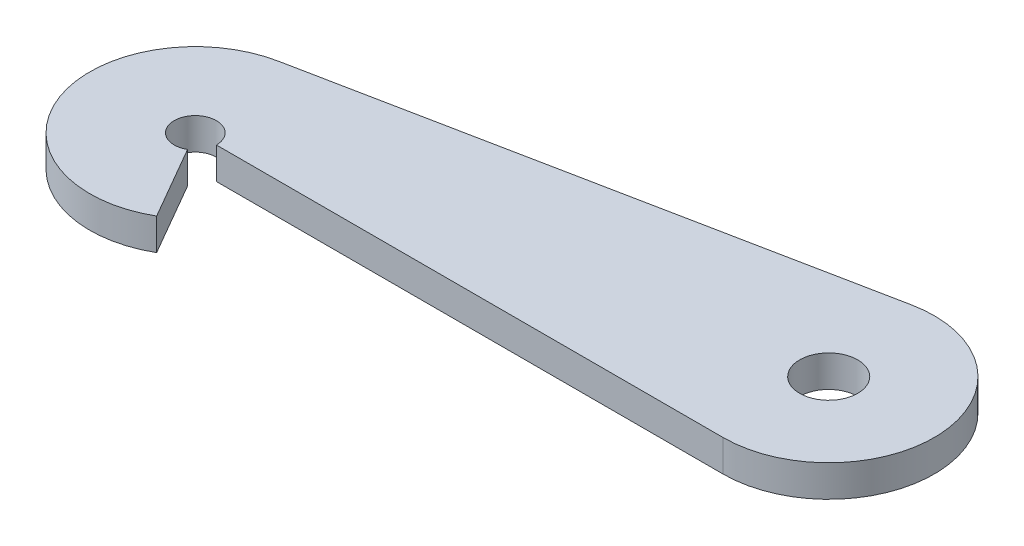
from build123d import *

# Parameters (mm, degrees)
SKETCH1_R      = 2.75
EXTRUDE1_DEPTH = 3


with BuildPart() as part:
    # Sketch1 → Extrude1 (new body)
    with BuildSketch(Plane(origin=(0, 0, 0), x_dir=(1, 0, 0), z_dir=(0, 1, 0))):
        with BuildLine():
            Line((48.038838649, 19.805806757), (-1.961161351, 9.805806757))
            ThreePointArc((-1.961161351, 9.805806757), (-9.357215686, -3.527394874), (5, -8.660254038))
            Line((5, -8.660254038), (1, -1.732050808))
            ThreePointArc((1, -1.732050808), (-1.732050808, 1), (2, 0))
            Line((2, 0), (50, 0))
            ThreePointArc((50, 0), (59.951333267, 10.98537618), (48.038838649, 19.805806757))
        make_face()
        with Locations(Location((50, 10, 0), (0, 0, 270))):
            Circle(SKETCH1_R, mode=Mode.SUBTRACT)
    extrude(amount=EXTRUDE1_DEPTH)


solid = part.part
